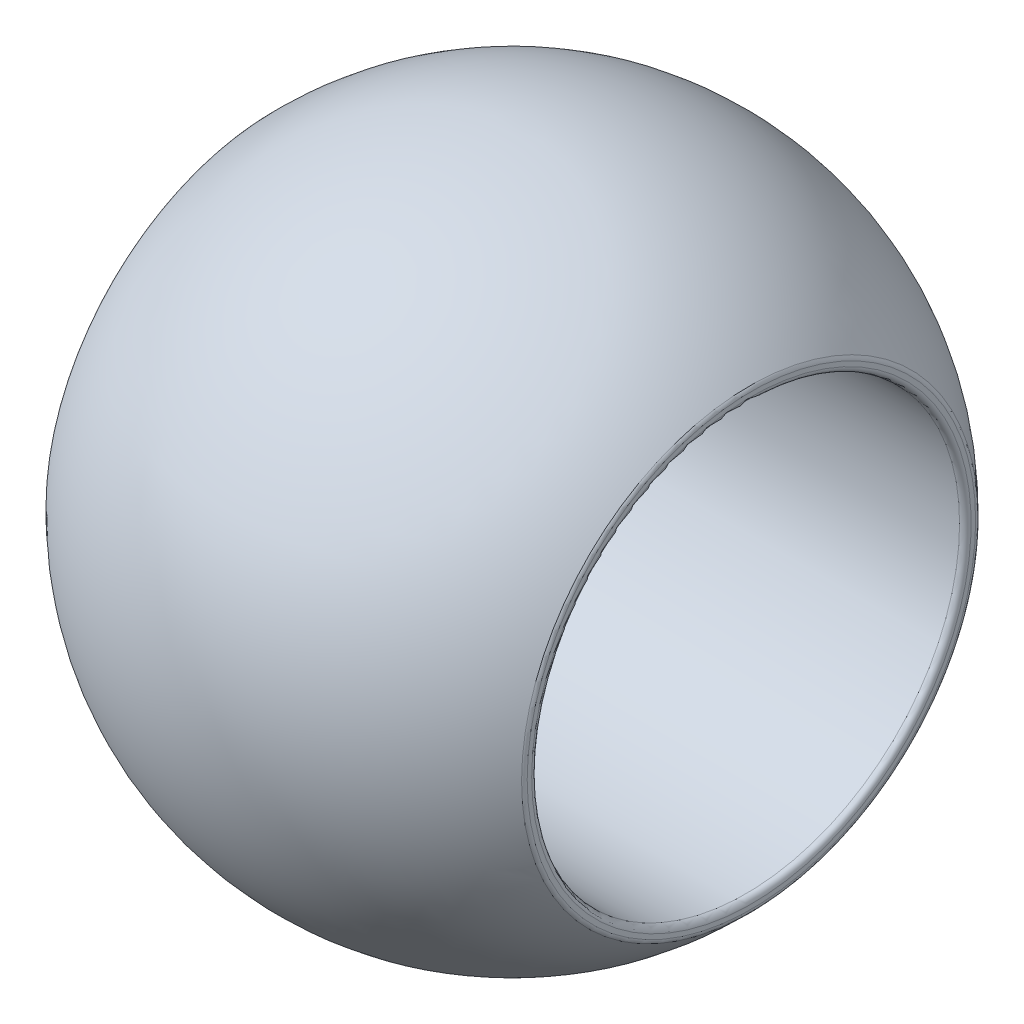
ISO-10303-21;
HEADER;
FILE_DESCRIPTION(('STEP AP214'),'2;1');
FILE_NAME('part.step','',(''),(''),'','','');
FILE_SCHEMA(('AUTOMOTIVE_DESIGN { 1 0 10303 214 1 1 1 1 }'));
ENDSEC;
DATA;
#1=APPLICATION_CONTEXT('core data for automotive mechanical design processes');
#2=APPLICATION_PROTOCOL_DEFINITION('international standard','automotive_design',2000,#1);
#3=PRODUCT_CONTEXT('',#1,'mechanical');
#4=PRODUCT('Part','Part','',(#3));
#5=PRODUCT_RELATED_PRODUCT_CATEGORY('part','',(#4));
#6=PRODUCT_DEFINITION_FORMATION('','',#4);
#7=PRODUCT_DEFINITION_CONTEXT('part definition',#1,'design');
#8=PRODUCT_DEFINITION('design','',#6,#7);
#9=PRODUCT_DEFINITION_SHAPE('','',#8);
#10=(LENGTH_UNIT() NAMED_UNIT(*) SI_UNIT(.MILLI.,.METRE.));
#11=(NAMED_UNIT(*) PLANE_ANGLE_UNIT() SI_UNIT($,.RADIAN.));
#12=(NAMED_UNIT(*) SI_UNIT($,.STERADIAN.) SOLID_ANGLE_UNIT());
#13=UNCERTAINTY_MEASURE_WITH_UNIT(LENGTH_MEASURE(1.E-05),#10,'distance_accuracy_value','');
#14=(GEOMETRIC_REPRESENTATION_CONTEXT(3) GLOBAL_UNCERTAINTY_ASSIGNED_CONTEXT((#13)) GLOBAL_UNIT_ASSIGNED_CONTEXT((#10,
#11,#12)) REPRESENTATION_CONTEXT('',''));
#15=CARTESIAN_POINT('',(0.,0.,0.));
#16=DIRECTION('',(0.,0.,1.));
#17=DIRECTION('',(1.,0.,0.));
#18=AXIS2_PLACEMENT_3D('',#15,#16,#17);
#19=CARTESIAN_POINT('',(0.,0.,0.));
#20=DIRECTION('',(0.,-1.,0.));
#21=DIRECTION('',(-1.,0.,0.));
#22=AXIS2_PLACEMENT_3D('',#19,#20,#21);
#23=SPHERICAL_SURFACE('',#22,14.25);
#24=CARTESIAN_POINT('',(10.2803571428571,0.,0.));
#25=DIRECTION('',(-1.,0.,0.));
#26=DIRECTION('',(0.,0.,1.));
#27=AXIS2_PLACEMENT_3D('',#24,#25,#26);
#28=CIRCLE('',#27,9.86796620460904);
#29=CARTESIAN_POINT('',(10.2803571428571,0.,9.86796620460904));
#30=VERTEX_POINT('',#29);
#31=EDGE_CURVE('E99',#30,#30,#28,.T.);
#32=ORIENTED_EDGE('',*,*,#31,.T.);
#33=EDGE_LOOP('',(#32));
#34=FACE_BOUND('',#33,.T.);
#35=CARTESIAN_POINT('',(-10.2803571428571,0.,0.));
#36=DIRECTION('',(1.,0.,0.));
#37=DIRECTION('',(0.,0.,-1.));
#38=AXIS2_PLACEMENT_3D('',#35,#36,#37);
#39=CIRCLE('',#38,9.86796620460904);
#40=CARTESIAN_POINT('',(-10.2803571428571,0.,-9.86796620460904));
#41=VERTEX_POINT('',#40);
#42=EDGE_CURVE('E101',#41,#41,#39,.T.);
#43=ORIENTED_EDGE('',*,*,#42,.T.);
#44=EDGE_LOOP('',(#43));
#45=FACE_BOUND('',#44,.T.);
#46=CARTESIAN_POINT('',(-2.00019999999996,-12.3623415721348,-6.79957431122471));
#47=CARTESIAN_POINT('',(-1.83437690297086,-12.3772510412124,-6.82124714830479));
#48=CARTESIAN_POINT('',(-1.66804642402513,-12.3903468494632,-6.84014670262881));
#49=CARTESIAN_POINT('',(-1.3346088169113,-12.412844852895,-6.87246584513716));
#50=CARTESIAN_POINT('',(-1.16750170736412,-12.4222471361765,-6.8858855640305));
#51=CARTESIAN_POINT('',(-0.667467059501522,-12.4447205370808,-6.9178913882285));
#52=CARTESIAN_POINT('',(-0.333733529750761,-12.4522471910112,-6.92849477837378));
#53=CARTESIAN_POINT('',(0.333733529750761,-12.4522471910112,-6.92849477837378));
#54=CARTESIAN_POINT('',(0.667467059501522,-12.4447205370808,-6.9178913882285));
#55=CARTESIAN_POINT('',(1.16750170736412,-12.4222471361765,-6.8858855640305));
#56=CARTESIAN_POINT('',(1.3346088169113,-12.412844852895,-6.87246584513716));
#57=CARTESIAN_POINT('',(1.66804642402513,-12.3903468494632,-6.84014670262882));
#58=CARTESIAN_POINT('',(1.83437690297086,-12.3772510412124,-6.8212471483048));
#59=CARTESIAN_POINT('',(2.00019999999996,-12.3623415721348,-6.79957431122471));
#60=B_SPLINE_CURVE_WITH_KNOTS('',3,(#46,#47,#48,#49,#50,#51,#52,#53,#54,#55,#56,#57,#58,#59),
.UNSPECIFIED.,.F.,.F.,(4,2,2,2,2,2,4),(0.,0.503621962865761,1.00723191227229,2.00811417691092,
3.00899644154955,3.51260639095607,4.01622835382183),.UNSPECIFIED.);
#61=CARTESIAN_POINT('',(-2.,-12.3623595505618,-6.79960045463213));
#62=VERTEX_POINT('',#61);
#63=CARTESIAN_POINT('',(2.,-12.3623595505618,-6.79960045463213));
#64=VERTEX_POINT('',#63);
#65=EDGE_CURVE('E48',#62,#64,#60,.T.);
#66=ORIENTED_EDGE('',*,*,#65,.F.);
#67=CARTESIAN_POINT('',(-2.,0.,0.));
#68=DIRECTION('',(1.,0.,0.));
#69=DIRECTION('',(0.,0.,-1.));
#70=AXIS2_PLACEMENT_3D('',#67,#68,#69);
#71=CIRCLE('',#70,14.1089510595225);
#72=CARTESIAN_POINT('',(-2.,-12.3623595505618,6.79960045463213));
#73=VERTEX_POINT('',#72);
#74=EDGE_CURVE('E54',#62,#73,#71,.F.);
#75=ORIENTED_EDGE('',*,*,#74,.T.);
#76=CARTESIAN_POINT('',(2.0002,-12.3623415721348,6.7995743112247));
#77=CARTESIAN_POINT('',(1.83437690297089,-12.3772510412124,6.82124714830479));
#78=CARTESIAN_POINT('',(1.66804642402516,-12.3903468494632,6.84014670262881));
#79=CARTESIAN_POINT('',(1.33460881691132,-12.412844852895,6.87246584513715));
#80=CARTESIAN_POINT('',(1.16750170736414,-12.4222471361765,6.8858855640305));
#81=CARTESIAN_POINT('',(0.667467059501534,-12.4447205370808,6.9178913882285));
#82=CARTESIAN_POINT('',(0.333733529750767,-12.4522471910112,6.92849477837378));
#83=CARTESIAN_POINT('',(-0.333733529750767,-12.4522471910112,6.92849477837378));
#84=CARTESIAN_POINT('',(-0.667467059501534,-12.4447205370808,6.9178913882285));
#85=CARTESIAN_POINT('',(-1.16750170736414,-12.4222471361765,6.8858855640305));
#86=CARTESIAN_POINT('',(-1.33460881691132,-12.412844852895,6.87246584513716));
#87=CARTESIAN_POINT('',(-1.66804642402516,-12.3903468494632,6.84014670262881));
#88=CARTESIAN_POINT('',(-1.83437690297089,-12.3772510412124,6.82124714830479));
#89=CARTESIAN_POINT('',(-2.0002,-12.3623415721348,6.79957431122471));
#90=B_SPLINE_CURVE_WITH_KNOTS('',3,(#76,#77,#78,#79,#80,#81,#82,#83,#84,#85,#86,#87,#88,#89),
.UNSPECIFIED.,.F.,.F.,(4,2,2,2,2,2,4),(0.,0.503621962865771,1.00723191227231,2.00811417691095,
3.0089964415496,3.51260639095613,4.0162283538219),.UNSPECIFIED.);
#91=CARTESIAN_POINT('',(2.,-12.3623595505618,6.79960045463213));
#92=VERTEX_POINT('',#91);
#93=EDGE_CURVE('E37',#92,#73,#90,.T.);
#94=ORIENTED_EDGE('',*,*,#93,.F.);
#95=CARTESIAN_POINT('',(2.,0.,0.));
#96=DIRECTION('',(1.,0.,0.));
#97=DIRECTION('',(0.,0.,-1.));
#98=AXIS2_PLACEMENT_3D('',#95,#96,#97);
#99=CIRCLE('',#98,14.1089510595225);
#100=EDGE_CURVE('E44',#64,#92,#99,.F.);
#101=ORIENTED_EDGE('',*,*,#100,.F.);
#102=EDGE_LOOP('',(#66,#75,#94,#101));
#103=FACE_BOUND('',#102,.T.);
#104=ADVANCED_FACE('F16',(#34,#45,#103),#23,.T.);
#105=CARTESIAN_POINT('',(-10.35,9.25,0.));
#106=DIRECTION('',(1.,0.,0.));
#107=DIRECTION('',(0.,0.,-1.));
#108=AXIS2_PLACEMENT_3D('',#105,#106,#107);
#109=PLANE('',#108);
#110=CARTESIAN_POINT('',(-10.35,0.,0.));
#111=DIRECTION('',(1.,0.,0.));
#112=DIRECTION('',(0.,0.,-1.));
#113=AXIS2_PLACEMENT_3D('',#110,#111,#112);
#114=CIRCLE('',#113,9.5);
#115=CARTESIAN_POINT('',(-10.35,0.,-9.5));
#116=VERTEX_POINT('',#115);
#117=EDGE_CURVE('E11',#116,#116,#114,.T.);
#118=ORIENTED_EDGE('',*,*,#117,.T.);
#119=EDGE_LOOP('',(#118));
#120=FACE_BOUND('',#119,.T.);
#121=CARTESIAN_POINT('',(-10.35,0.,0.));
#122=DIRECTION('',(1.,0.,0.));
#123=DIRECTION('',(0.,0.,-1.));
#124=AXIS2_PLACEMENT_3D('',#121,#122,#123);
#125=CIRCLE('',#124,9.69484399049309);
#126=CARTESIAN_POINT('',(-10.35,0.,-9.69484399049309));
#127=VERTEX_POINT('',#126);
#128=EDGE_CURVE('E24',#127,#127,#125,.F.);
#129=ORIENTED_EDGE('',*,*,#128,.T.);
#130=EDGE_LOOP('',(#129));
#131=FACE_BOUND('',#130,.T.);
#132=ADVANCED_FACE('F84',(#120,#131),#109,.F.);
#133=CARTESIAN_POINT('',(-20.,0.,0.));
#134=DIRECTION('',(1.,0.,0.));
#135=DIRECTION('',(0.,0.,-1.));
#136=AXIS2_PLACEMENT_3D('',#133,#134,#135);
#137=CYLINDRICAL_SURFACE('',#136,9.25);
#138=CARTESIAN_POINT('',(10.1,0.,0.));
#139=DIRECTION('',(-1.,0.,0.));
#140=DIRECTION('',(0.,0.,1.));
#141=AXIS2_PLACEMENT_3D('',#138,#139,#140);
#142=CIRCLE('',#141,9.25);
#143=CARTESIAN_POINT('',(10.1,0.,9.25));
#144=VERTEX_POINT('',#143);
#145=EDGE_CURVE('E112',#144,#144,#142,.F.);
#146=ORIENTED_EDGE('',*,*,#145,.T.);
#147=EDGE_LOOP('',(#146));
#148=FACE_BOUND('',#147,.T.);
#149=CARTESIAN_POINT('',(-10.1,0.,0.));
#150=DIRECTION('',(1.,0.,0.));
#151=DIRECTION('',(0.,0.,-1.));
#152=AXIS2_PLACEMENT_3D('',#149,#150,#151);
#153=CIRCLE('',#152,9.25);
#154=CARTESIAN_POINT('',(-10.1,0.,-9.25));
#155=VERTEX_POINT('',#154);
#156=EDGE_CURVE('E56',#155,#155,#153,.F.);
#157=ORIENTED_EDGE('',*,*,#156,.T.);
#158=EDGE_LOOP('',(#157));
#159=FACE_BOUND('',#158,.T.);
#160=ADVANCED_FACE('F81',(#148,#159),#137,.F.);
#161=CARTESIAN_POINT('',(10.35,9.25,0.));
#162=DIRECTION('',(-1.,0.,0.));
#163=DIRECTION('',(0.,0.,1.));
#164=AXIS2_PLACEMENT_3D('',#161,#162,#163);
#165=PLANE('',#164);
#166=CARTESIAN_POINT('',(10.35,0.,0.));
#167=DIRECTION('',(-1.,0.,0.));
#168=DIRECTION('',(0.,0.,1.));
#169=AXIS2_PLACEMENT_3D('',#166,#167,#168);
#170=CIRCLE('',#169,9.5);
#171=CARTESIAN_POINT('',(10.35,0.,9.5));
#172=VERTEX_POINT('',#171);
#173=EDGE_CURVE('E106',#172,#172,#170,.T.);
#174=ORIENTED_EDGE('',*,*,#173,.T.);
#175=EDGE_LOOP('',(#174));
#176=FACE_BOUND('',#175,.T.);
#177=CARTESIAN_POINT('',(10.35,0.,0.));
#178=DIRECTION('',(-1.,0.,0.));
#179=DIRECTION('',(0.,0.,1.));
#180=AXIS2_PLACEMENT_3D('',#177,#178,#179);
#181=CIRCLE('',#180,9.69484399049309);
#182=CARTESIAN_POINT('',(10.35,0.,9.69484399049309));
#183=VERTEX_POINT('',#182);
#184=EDGE_CURVE('E109',#183,#183,#181,.F.);
#185=ORIENTED_EDGE('',*,*,#184,.T.);
#186=EDGE_LOOP('',(#185));
#187=FACE_BOUND('',#186,.T.);
#188=ADVANCED_FACE('F76',(#176,#187),#165,.F.);
#189=CARTESIAN_POINT('',(-2.,-22.25,0.));
#190=DIRECTION('',(1.,0.,0.));
#191=DIRECTION('',(0.,0.,-1.));
#192=AXIS2_PLACEMENT_3D('',#189,#190,#191);
#193=CYLINDRICAL_SURFACE('',#192,12.);
#194=ORIENTED_EDGE('',*,*,#93,.T.);
#195=CARTESIAN_POINT('',(-2.,-22.25,0.));
#196=DIRECTION('',(1.,0.,0.));
#197=DIRECTION('',(0.,0.,-1.));
#198=AXIS2_PLACEMENT_3D('',#195,#196,#197);
#199=CIRCLE('',#198,12.);
#200=EDGE_CURVE('E49',#62,#73,#199,.T.);
#201=ORIENTED_EDGE('',*,*,#200,.F.);
#202=ORIENTED_EDGE('',*,*,#65,.T.);
#203=CARTESIAN_POINT('',(2.,-22.25,0.));
#204=DIRECTION('',(1.,0.,0.));
#205=DIRECTION('',(0.,0.,-1.));
#206=AXIS2_PLACEMENT_3D('',#203,#204,#205);
#207=CIRCLE('',#206,12.);
#208=EDGE_CURVE('E30',#64,#92,#207,.T.);
#209=ORIENTED_EDGE('',*,*,#208,.T.);
#210=EDGE_LOOP('',(#194,#201,#202,#209));
#211=FACE_BOUND('',#210,.T.);
#212=ADVANCED_FACE('F51',(#211),#193,.F.);
#213=CARTESIAN_POINT('',(-2.,-22.25,0.));
#214=DIRECTION('',(1.,0.,0.));
#215=DIRECTION('',(0.,0.,-1.));
#216=AXIS2_PLACEMENT_3D('',#213,#214,#215);
#217=PLANE('',#216);
#218=ORIENTED_EDGE('',*,*,#200,.T.);
#219=ORIENTED_EDGE('',*,*,#74,.F.);
#220=EDGE_LOOP('',(#218,#219));
#221=FACE_BOUND('',#220,.T.);
#222=ADVANCED_FACE('F75',(#221),#217,.T.);
#223=CARTESIAN_POINT('',(2.,-22.25,0.));
#224=DIRECTION('',(1.,0.,0.));
#225=DIRECTION('',(0.,0.,-1.));
#226=AXIS2_PLACEMENT_3D('',#223,#224,#225);
#227=PLANE('',#226);
#228=ORIENTED_EDGE('',*,*,#100,.T.);
#229=ORIENTED_EDGE('',*,*,#208,.F.);
#230=EDGE_LOOP('',(#228,#229));
#231=FACE_BOUND('',#230,.T.);
#232=ADVANCED_FACE('F45',(#231),#227,.F.);
#233=CARTESIAN_POINT('',(10.1,0.,0.));
#234=DIRECTION('',(-1.,0.,0.));
#235=DIRECTION('',(0.,0.,1.));
#236=AXIS2_PLACEMENT_3D('',#233,#234,#235);
#237=TOROIDAL_SURFACE('',#236,9.5,0.25);
#238=ORIENTED_EDGE('',*,*,#173,.F.);
#239=EDGE_LOOP('',(#238));
#240=FACE_BOUND('',#239,.T.);
#241=ORIENTED_EDGE('',*,*,#145,.F.);
#242=EDGE_LOOP('',(#241));
#243=FACE_BOUND('',#242,.T.);
#244=ADVANCED_FACE('F128',(#240,#243),#237,.T.);
#245=CARTESIAN_POINT('',(10.1,0.,0.));
#246=DIRECTION('',(-1.,0.,0.));
#247=DIRECTION('',(0.,0.,1.));
#248=AXIS2_PLACEMENT_3D('',#245,#246,#247);
#249=TOROIDAL_SURFACE('',#248,9.69484399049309,0.25);
#250=ORIENTED_EDGE('',*,*,#31,.F.);
#251=EDGE_LOOP('',(#250));
#252=FACE_BOUND('',#251,.T.);
#253=ORIENTED_EDGE('',*,*,#184,.F.);
#254=EDGE_LOOP('',(#253));
#255=FACE_BOUND('',#254,.T.);
#256=ADVANCED_FACE('F121',(#252,#255),#249,.T.);
#257=CARTESIAN_POINT('',(-10.1,0.,0.));
#258=DIRECTION('',(1.,0.,0.));
#259=DIRECTION('',(0.,0.,-1.));
#260=AXIS2_PLACEMENT_3D('',#257,#258,#259);
#261=TOROIDAL_SURFACE('',#260,9.5,0.25);
#262=ORIENTED_EDGE('',*,*,#156,.F.);
#263=EDGE_LOOP('',(#262));
#264=FACE_BOUND('',#263,.T.);
#265=ORIENTED_EDGE('',*,*,#117,.F.);
#266=EDGE_LOOP('',(#265));
#267=FACE_BOUND('',#266,.T.);
#268=ADVANCED_FACE('F118',(#264,#267),#261,.T.);
#269=CARTESIAN_POINT('',(-10.1,0.,0.));
#270=DIRECTION('',(1.,0.,0.));
#271=DIRECTION('',(0.,0.,-1.));
#272=AXIS2_PLACEMENT_3D('',#269,#270,#271);
#273=TOROIDAL_SURFACE('',#272,9.69484399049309,0.25);
#274=ORIENTED_EDGE('',*,*,#42,.F.);
#275=EDGE_LOOP('',(#274));
#276=FACE_BOUND('',#275,.T.);
#277=ORIENTED_EDGE('',*,*,#128,.F.);
#278=EDGE_LOOP('',(#277));
#279=FACE_BOUND('',#278,.T.);
#280=ADVANCED_FACE('F18',(#276,#279),#273,.T.);
#281=CLOSED_SHELL('',(#104,#132,#160,#188,#212,#222,#232,#244,#256,#268,#280));
#282=MANIFOLD_SOLID_BREP('B1',#281);
#283=ADVANCED_BREP_SHAPE_REPRESENTATION('',(#18,#282),#14);
#284=SHAPE_DEFINITION_REPRESENTATION(#9,#283);
ENDSEC;
END-ISO-10303-21;
